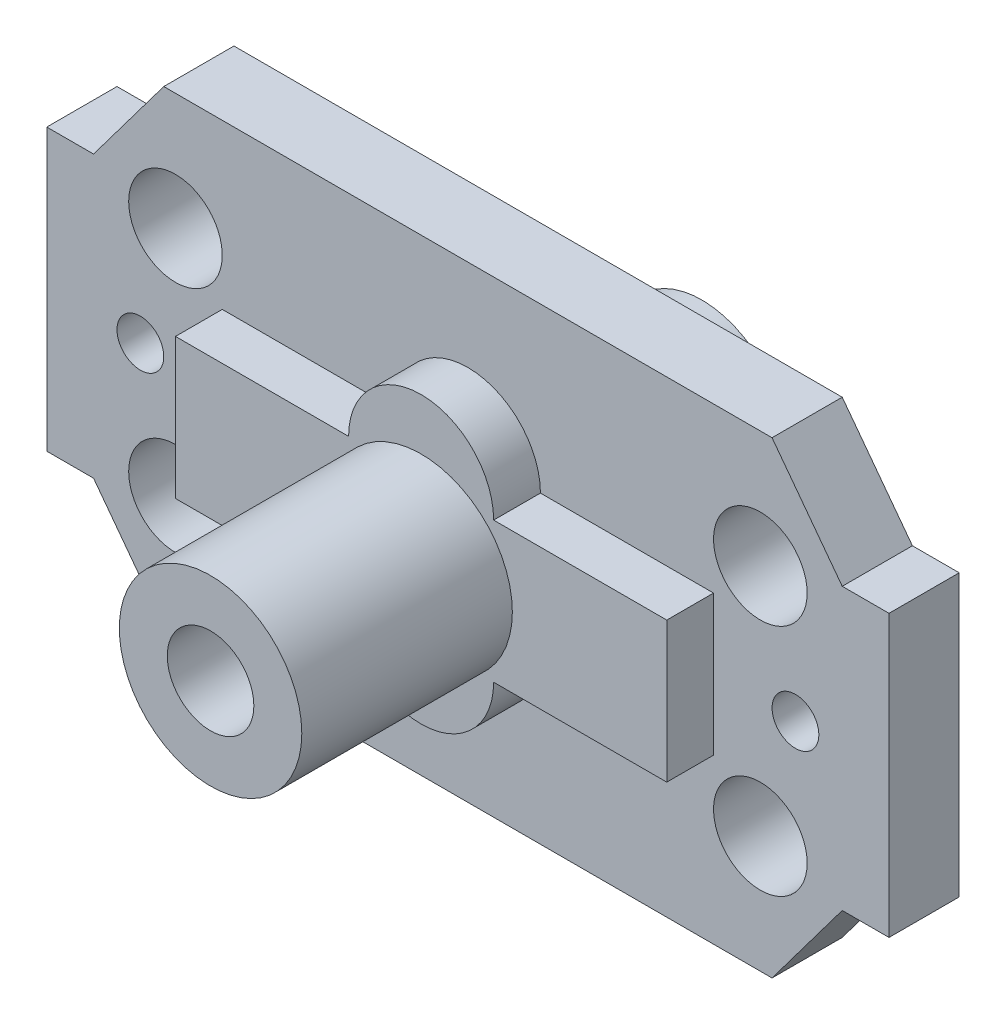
ISO-10303-21;
HEADER;
FILE_DESCRIPTION(('STEP AP214'),'2;1');
FILE_NAME('part.step','',(''),(''),'','','');
FILE_SCHEMA(('AUTOMOTIVE_DESIGN { 1 0 10303 214 1 1 1 1 }'));
ENDSEC;
DATA;
#1=APPLICATION_CONTEXT('core data for automotive mechanical design processes');
#2=APPLICATION_PROTOCOL_DEFINITION('international standard','automotive_design',2000,#1);
#3=PRODUCT_CONTEXT('',#1,'mechanical');
#4=PRODUCT('Part','Part','',(#3));
#5=PRODUCT_RELATED_PRODUCT_CATEGORY('part','',(#4));
#6=PRODUCT_DEFINITION_FORMATION('','',#4);
#7=PRODUCT_DEFINITION_CONTEXT('part definition',#1,'design');
#8=PRODUCT_DEFINITION('design','',#6,#7);
#9=PRODUCT_DEFINITION_SHAPE('','',#8);
#10=(LENGTH_UNIT() NAMED_UNIT(*) SI_UNIT(.MILLI.,.METRE.));
#11=(NAMED_UNIT(*) PLANE_ANGLE_UNIT() SI_UNIT($,.RADIAN.));
#12=(NAMED_UNIT(*) SI_UNIT($,.STERADIAN.) SOLID_ANGLE_UNIT());
#13=UNCERTAINTY_MEASURE_WITH_UNIT(LENGTH_MEASURE(1.E-05),#10,'distance_accuracy_value','');
#14=(GEOMETRIC_REPRESENTATION_CONTEXT(3) GLOBAL_UNCERTAINTY_ASSIGNED_CONTEXT((#13)) GLOBAL_UNIT_ASSIGNED_CONTEXT((#10,
#11,#12)) REPRESENTATION_CONTEXT('',''));
#15=CARTESIAN_POINT('',(0.,0.,0.));
#16=DIRECTION('',(0.,0.,1.));
#17=DIRECTION('',(1.,0.,0.));
#18=AXIS2_PLACEMENT_3D('',#15,#16,#17);
#19=CARTESIAN_POINT('',(0.,1.5,2.5));
#20=DIRECTION('',(0.,0.,-1.));
#21=DIRECTION('',(-1.,0.,0.));
#22=AXIS2_PLACEMENT_3D('',#19,#20,#21);
#23=CYLINDRICAL_SURFACE('',#22,1.55);
#24=DIRECTION('',(0.,0.,-1.));
#25=VECTOR('',#24,1.);
#26=CARTESIAN_POINT('',(-1.55,1.5,2.5));
#27=LINE('',#26,#25);
#28=CARTESIAN_POINT('',(-1.55,1.5,2.5));
#29=VERTEX_POINT('',#28);
#30=CARTESIAN_POINT('',(-1.55,1.5,1.5));
#31=VERTEX_POINT('',#30);
#32=EDGE_CURVE('E206',#29,#31,#27,.T.);
#33=ORIENTED_EDGE('',*,*,#32,.F.);
#34=CARTESIAN_POINT('',(0.,1.5,2.5));
#35=DIRECTION('',(0.,0.,1.));
#36=DIRECTION('',(1.,0.,0.));
#37=AXIS2_PLACEMENT_3D('',#34,#35,#36);
#38=CIRCLE('',#37,1.55);
#39=CARTESIAN_POINT('',(1.55,1.5,2.5));
#40=VERTEX_POINT('',#39);
#41=EDGE_CURVE('E334',#40,#29,#38,.T.);
#42=ORIENTED_EDGE('',*,*,#41,.F.);
#43=DIRECTION('',(0.,0.,-1.));
#44=VECTOR('',#43,1.);
#45=CARTESIAN_POINT('',(1.55,1.5,2.5));
#46=LINE('',#45,#44);
#47=CARTESIAN_POINT('',(1.55,1.5,1.5));
#48=VERTEX_POINT('',#47);
#49=EDGE_CURVE('E336',#40,#48,#46,.T.);
#50=ORIENTED_EDGE('',*,*,#49,.T.);
#51=CARTESIAN_POINT('',(0.,1.5,1.5));
#52=DIRECTION('',(0.,0.,1.));
#53=DIRECTION('',(1.,0.,0.));
#54=AXIS2_PLACEMENT_3D('',#51,#52,#53);
#55=CIRCLE('',#54,1.55);
#56=EDGE_CURVE('E48',#48,#31,#55,.T.);
#57=ORIENTED_EDGE('',*,*,#56,.T.);
#58=EDGE_LOOP('',(#33,#42,#50,#57));
#59=FACE_BOUND('',#58,.T.);
#60=ADVANCED_FACE('F32',(#59),#23,.T.);
#61=CARTESIAN_POINT('',(0.,-1.5,2.5));
#62=DIRECTION('',(0.,0.,-1.));
#63=DIRECTION('',(-1.,0.,0.));
#64=AXIS2_PLACEMENT_3D('',#61,#62,#63);
#65=CYLINDRICAL_SURFACE('',#64,1.55);
#66=DIRECTION('',(0.,0.,-1.));
#67=VECTOR('',#66,1.);
#68=CARTESIAN_POINT('',(-1.55,-1.5,2.5));
#69=LINE('',#68,#67);
#70=CARTESIAN_POINT('',(-1.55,-1.5,2.5));
#71=VERTEX_POINT('',#70);
#72=CARTESIAN_POINT('',(-1.55,-1.5,1.5));
#73=VERTEX_POINT('',#72);
#74=EDGE_CURVE('E190',#71,#73,#69,.T.);
#75=ORIENTED_EDGE('',*,*,#74,.T.);
#76=CARTESIAN_POINT('',(0.,-1.5,1.5));
#77=DIRECTION('',(0.,0.,-1.));
#78=DIRECTION('',(1.,0.,0.));
#79=AXIS2_PLACEMENT_3D('',#76,#77,#78);
#80=CIRCLE('',#79,1.55);
#81=CARTESIAN_POINT('',(1.55,-1.5,1.5));
#82=VERTEX_POINT('',#81);
#83=EDGE_CURVE('E267',#82,#73,#80,.T.);
#84=ORIENTED_EDGE('',*,*,#83,.F.);
#85=DIRECTION('',(0.,0.,-1.));
#86=VECTOR('',#85,1.);
#87=CARTESIAN_POINT('',(1.55,-1.5,2.5));
#88=LINE('',#87,#86);
#89=CARTESIAN_POINT('',(1.55,-1.5,2.5));
#90=VERTEX_POINT('',#89);
#91=EDGE_CURVE('E269',#90,#82,#88,.T.);
#92=ORIENTED_EDGE('',*,*,#91,.F.);
#93=CARTESIAN_POINT('',(0.,-1.5,2.5));
#94=DIRECTION('',(0.,0.,-1.));
#95=DIRECTION('',(1.,0.,0.));
#96=AXIS2_PLACEMENT_3D('',#93,#94,#95);
#97=CIRCLE('',#96,1.55);
#98=EDGE_CURVE('E266',#90,#71,#97,.T.);
#99=ORIENTED_EDGE('',*,*,#98,.T.);
#100=EDGE_LOOP('',(#75,#84,#92,#99));
#101=FACE_BOUND('',#100,.T.);
#102=ADVANCED_FACE('F393',(#101),#65,.T.);
#103=CARTESIAN_POINT('',(0.,0.,7.));
#104=DIRECTION('',(0.,0.,-1.));
#105=DIRECTION('',(-1.,0.,0.));
#106=AXIS2_PLACEMENT_3D('',#103,#104,#105);
#107=CYLINDRICAL_SURFACE('',#106,1.95);
#108=CARTESIAN_POINT('',(0.,0.,7.));
#109=DIRECTION('',(0.,0.,1.));
#110=DIRECTION('',(1.,0.,0.));
#111=AXIS2_PLACEMENT_3D('',#108,#109,#110);
#112=CIRCLE('',#111,1.95);
#113=CARTESIAN_POINT('',(1.95,0.,7.));
#114=VERTEX_POINT('',#113);
#115=EDGE_CURVE('E324',#114,#114,#112,.T.);
#116=ORIENTED_EDGE('',*,*,#115,.F.);
#117=EDGE_LOOP('',(#116));
#118=FACE_BOUND('',#117,.T.);
#119=CARTESIAN_POINT('',(0.,0.,2.5));
#120=DIRECTION('',(0.,0.,1.));
#121=DIRECTION('',(1.,0.,0.));
#122=AXIS2_PLACEMENT_3D('',#119,#120,#121);
#123=CIRCLE('',#122,1.95);
#124=CARTESIAN_POINT('',(1.95,0.,2.5));
#125=VERTEX_POINT('',#124);
#126=EDGE_CURVE('E365',#125,#125,#123,.F.);
#127=ORIENTED_EDGE('',*,*,#126,.F.);
#128=EDGE_LOOP('',(#127));
#129=FACE_BOUND('',#128,.T.);
#130=ADVANCED_FACE('F399',(#118,#129),#107,.T.);
#131=CARTESIAN_POINT('',(9.,0.,0.));
#132=DIRECTION('',(0.,0.,1.));
#133=DIRECTION('',(1.,0.,0.));
#134=AXIS2_PLACEMENT_3D('',#131,#132,#133);
#135=PLANE('',#134);
#136=CARTESIAN_POINT('',(0.,0.,0.));
#137=DIRECTION('',(0.,0.,-1.));
#138=DIRECTION('',(-1.,0.,0.));
#139=AXIS2_PLACEMENT_3D('',#136,#137,#138);
#140=CIRCLE('',#139,1.8);
#141=CARTESIAN_POINT('',(-1.8,0.,0.));
#142=VERTEX_POINT('',#141);
#143=EDGE_CURVE('E320',#142,#142,#140,.T.);
#144=ORIENTED_EDGE('',*,*,#143,.F.);
#145=EDGE_LOOP('',(#144));
#146=FACE_BOUND('',#145,.T.);
#147=CARTESIAN_POINT('',(7.,0.,0.));
#148=DIRECTION('',(0.,0.,1.));
#149=DIRECTION('',(1.,0.,0.));
#150=AXIS2_PLACEMENT_3D('',#147,#148,#149);
#151=CIRCLE('',#150,0.500000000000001);
#152=CARTESIAN_POINT('',(7.5,0.,0.));
#153=VERTEX_POINT('',#152);
#154=EDGE_CURVE('E317',#153,#153,#151,.T.);
#155=ORIENTED_EDGE('',*,*,#154,.T.);
#156=EDGE_LOOP('',(#155));
#157=FACE_BOUND('',#156,.T.);
#158=CARTESIAN_POINT('',(6.25,2.5,0.));
#159=DIRECTION('',(0.,0.,1.));
#160=DIRECTION('',(1.,0.,0.));
#161=AXIS2_PLACEMENT_3D('',#158,#159,#160);
#162=CIRCLE('',#161,1.);
#163=CARTESIAN_POINT('',(7.25,2.5,0.));
#164=VERTEX_POINT('',#163);
#165=EDGE_CURVE('E314',#164,#164,#162,.T.);
#166=ORIENTED_EDGE('',*,*,#165,.T.);
#167=EDGE_LOOP('',(#166));
#168=FACE_BOUND('',#167,.T.);
#169=CARTESIAN_POINT('',(3.5,2.,0.));
#170=DIRECTION('',(0.,0.,1.));
#171=DIRECTION('',(1.,0.,0.));
#172=AXIS2_PLACEMENT_3D('',#169,#170,#171);
#173=CIRCLE('',#172,0.5);
#174=CARTESIAN_POINT('',(4.,2.,0.));
#175=VERTEX_POINT('',#174);
#176=EDGE_CURVE('E372',#175,#175,#173,.F.);
#177=ORIENTED_EDGE('',*,*,#176,.F.);
#178=EDGE_LOOP('',(#177));
#179=FACE_BOUND('',#178,.T.);
#180=DIRECTION('',(0.,1.,0.));
#181=VECTOR('',#180,1.);
#182=CARTESIAN_POINT('',(9.,0.,0.));
#183=LINE('',#182,#181);
#184=CARTESIAN_POINT('',(9.,-3.,0.));
#185=VERTEX_POINT('',#184);
#186=CARTESIAN_POINT('',(9.,3.,0.));
#187=VERTEX_POINT('',#186);
#188=EDGE_CURVE('E345',#185,#187,#183,.T.);
#189=ORIENTED_EDGE('',*,*,#188,.F.);
#190=DIRECTION('',(-1.,0.,0.));
#191=VECTOR('',#190,1.);
#192=CARTESIAN_POINT('',(8.,-3.,0.));
#193=LINE('',#192,#191);
#194=CARTESIAN_POINT('',(8.,-3.,0.));
#195=VERTEX_POINT('',#194);
#196=EDGE_CURVE('E277',#185,#195,#193,.T.);
#197=ORIENTED_EDGE('',*,*,#196,.T.);
#198=DIRECTION('',(-0.600000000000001,-0.799999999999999,0.));
#199=VECTOR('',#198,1.);
#200=CARTESIAN_POINT('',(6.5,-5.,0.));
#201=LINE('',#200,#199);
#202=CARTESIAN_POINT('',(6.5,-5.,0.));
#203=VERTEX_POINT('',#202);
#204=EDGE_CURVE('E290',#195,#203,#201,.T.);
#205=ORIENTED_EDGE('',*,*,#204,.T.);
#206=DIRECTION('',(-1.,0.,0.));
#207=VECTOR('',#206,1.);
#208=CARTESIAN_POINT('',(0.,-5.,0.));
#209=LINE('',#208,#207);
#210=CARTESIAN_POINT('',(-6.5,-5.,0.));
#211=VERTEX_POINT('',#210);
#212=EDGE_CURVE('E282',#203,#211,#209,.T.);
#213=ORIENTED_EDGE('',*,*,#212,.T.);
#214=DIRECTION('',(0.600000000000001,-0.799999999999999,0.));
#215=VECTOR('',#214,1.);
#216=CARTESIAN_POINT('',(-6.5,-5.,0.));
#217=LINE('',#216,#215);
#218=CARTESIAN_POINT('',(-8.,-3.,0.));
#219=VERTEX_POINT('',#218);
#220=EDGE_CURVE('E917',#219,#211,#217,.T.);
#221=ORIENTED_EDGE('',*,*,#220,.F.);
#222=DIRECTION('',(1.,0.,0.));
#223=VECTOR('',#222,1.);
#224=CARTESIAN_POINT('',(-8.,-3.,0.));
#225=LINE('',#224,#223);
#226=CARTESIAN_POINT('',(-9.,-3.,0.));
#227=VERTEX_POINT('',#226);
#228=EDGE_CURVE('E189',#227,#219,#225,.T.);
#229=ORIENTED_EDGE('',*,*,#228,.F.);
#230=DIRECTION('',(0.,1.,0.));
#231=VECTOR('',#230,1.);
#232=CARTESIAN_POINT('',(-9.,0.,0.));
#233=LINE('',#232,#231);
#234=CARTESIAN_POINT('',(-9.,3.,0.));
#235=VERTEX_POINT('',#234);
#236=EDGE_CURVE('E217',#227,#235,#233,.T.);
#237=ORIENTED_EDGE('',*,*,#236,.T.);
#238=DIRECTION('',(1.,0.,0.));
#239=VECTOR('',#238,1.);
#240=CARTESIAN_POINT('',(-8.,3.,0.));
#241=LINE('',#240,#239);
#242=CARTESIAN_POINT('',(-8.,3.,0.));
#243=VERTEX_POINT('',#242);
#244=EDGE_CURVE('E231',#235,#243,#241,.T.);
#245=ORIENTED_EDGE('',*,*,#244,.T.);
#246=DIRECTION('',(0.600000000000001,0.799999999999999,0.));
#247=VECTOR('',#246,1.);
#248=CARTESIAN_POINT('',(-6.5,5.,0.));
#249=LINE('',#248,#247);
#250=CARTESIAN_POINT('',(-6.5,5.,0.));
#251=VERTEX_POINT('',#250);
#252=EDGE_CURVE('E222',#243,#251,#249,.T.);
#253=ORIENTED_EDGE('',*,*,#252,.T.);
#254=DIRECTION('',(-1.,0.,0.));
#255=VECTOR('',#254,1.);
#256=CARTESIAN_POINT('',(0.,5.,0.));
#257=LINE('',#256,#255);
#258=CARTESIAN_POINT('',(6.5,5.,0.));
#259=VERTEX_POINT('',#258);
#260=EDGE_CURVE('E348',#259,#251,#257,.T.);
#261=ORIENTED_EDGE('',*,*,#260,.F.);
#262=DIRECTION('',(-0.600000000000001,0.799999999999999,0.));
#263=VECTOR('',#262,1.);
#264=CARTESIAN_POINT('',(6.5,5.,0.));
#265=LINE('',#264,#263);
#266=CARTESIAN_POINT('',(8.,3.,0.));
#267=VERTEX_POINT('',#266);
#268=EDGE_CURVE('E74',#267,#259,#265,.T.);
#269=ORIENTED_EDGE('',*,*,#268,.F.);
#270=DIRECTION('',(-1.,0.,0.));
#271=VECTOR('',#270,1.);
#272=CARTESIAN_POINT('',(8.,3.,0.));
#273=LINE('',#272,#271);
#274=EDGE_CURVE('E355',#187,#267,#273,.T.);
#275=ORIENTED_EDGE('',*,*,#274,.F.);
#276=EDGE_LOOP('',(#189,#197,#205,#213,#221,#229,#237,#245,#253,#261,#269,#275));
#277=FACE_BOUND('',#276,.T.);
#278=CARTESIAN_POINT('',(6.25,-2.5,0.));
#279=DIRECTION('',(0.,0.,-1.));
#280=DIRECTION('',(1.,0.,0.));
#281=AXIS2_PLACEMENT_3D('',#278,#279,#280);
#282=CIRCLE('',#281,1.);
#283=CARTESIAN_POINT('',(7.25,-2.5,0.));
#284=VERTEX_POINT('',#283);
#285=EDGE_CURVE('E260',#284,#284,#282,.T.);
#286=ORIENTED_EDGE('',*,*,#285,.F.);
#287=EDGE_LOOP('',(#286));
#288=FACE_BOUND('',#287,.T.);
#289=CARTESIAN_POINT('',(3.5,-2.,0.));
#290=DIRECTION('',(0.,0.,-1.));
#291=DIRECTION('',(1.,0.,0.));
#292=AXIS2_PLACEMENT_3D('',#289,#290,#291);
#293=CIRCLE('',#292,0.5);
#294=CARTESIAN_POINT('',(4.,-2.,0.));
#295=VERTEX_POINT('',#294);
#296=EDGE_CURVE('E300',#295,#295,#293,.F.);
#297=ORIENTED_EDGE('',*,*,#296,.T.);
#298=EDGE_LOOP('',(#297));
#299=FACE_BOUND('',#298,.T.);
#300=CARTESIAN_POINT('',(-7.,0.,0.));
#301=DIRECTION('',(0.,0.,-1.));
#302=DIRECTION('',(-1.,0.,0.));
#303=AXIS2_PLACEMENT_3D('',#300,#301,#302);
#304=CIRCLE('',#303,0.500000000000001);
#305=CARTESIAN_POINT('',(-7.5,0.,0.));
#306=VERTEX_POINT('',#305);
#307=EDGE_CURVE('E210',#306,#306,#304,.T.);
#308=ORIENTED_EDGE('',*,*,#307,.F.);
#309=EDGE_LOOP('',(#308));
#310=FACE_BOUND('',#309,.T.);
#311=CARTESIAN_POINT('',(-6.25,2.5,0.));
#312=DIRECTION('',(0.,0.,-1.));
#313=DIRECTION('',(-1.,0.,0.));
#314=AXIS2_PLACEMENT_3D('',#311,#312,#313);
#315=CIRCLE('',#314,1.);
#316=CARTESIAN_POINT('',(-7.25,2.5,0.));
#317=VERTEX_POINT('',#316);
#318=EDGE_CURVE('E258',#317,#317,#315,.T.);
#319=ORIENTED_EDGE('',*,*,#318,.F.);
#320=EDGE_LOOP('',(#319));
#321=FACE_BOUND('',#320,.T.);
#322=CARTESIAN_POINT('',(-3.5,2.,0.));
#323=DIRECTION('',(0.,0.,-1.));
#324=DIRECTION('',(-1.,0.,0.));
#325=AXIS2_PLACEMENT_3D('',#322,#323,#324);
#326=CIRCLE('',#325,0.5);
#327=CARTESIAN_POINT('',(-4.,2.,0.));
#328=VERTEX_POINT('',#327);
#329=EDGE_CURVE('E242',#328,#328,#326,.F.);
#330=ORIENTED_EDGE('',*,*,#329,.T.);
#331=EDGE_LOOP('',(#330));
#332=FACE_BOUND('',#331,.T.);
#333=CARTESIAN_POINT('',(-6.25,-2.5,0.));
#334=DIRECTION('',(0.,0.,1.));
#335=DIRECTION('',(-1.,0.,0.));
#336=AXIS2_PLACEMENT_3D('',#333,#334,#335);
#337=CIRCLE('',#336,1.);
#338=CARTESIAN_POINT('',(-7.25,-2.5,0.));
#339=VERTEX_POINT('',#338);
#340=EDGE_CURVE('E480',#339,#339,#337,.T.);
#341=ORIENTED_EDGE('',*,*,#340,.T.);
#342=EDGE_LOOP('',(#341));
#343=FACE_BOUND('',#342,.T.);
#344=CARTESIAN_POINT('',(-3.5,-2.,0.));
#345=DIRECTION('',(0.,0.,1.));
#346=DIRECTION('',(-1.,0.,0.));
#347=AXIS2_PLACEMENT_3D('',#344,#345,#346);
#348=CIRCLE('',#347,0.5);
#349=CARTESIAN_POINT('',(-4.,-2.,0.));
#350=VERTEX_POINT('',#349);
#351=EDGE_CURVE('E467',#350,#350,#348,.F.);
#352=ORIENTED_EDGE('',*,*,#351,.F.);
#353=EDGE_LOOP('',(#352));
#354=FACE_BOUND('',#353,.T.);
#355=ADVANCED_FACE('F418',(#146,#157,#168,#179,#277,#288,#299,#310,#321,#332,#343,#354),#135,.F.);
#356=CARTESIAN_POINT('',(0.,1.5,2.5));
#357=DIRECTION('',(0.,0.,1.));
#358=DIRECTION('',(1.,0.,0.));
#359=AXIS2_PLACEMENT_3D('',#356,#357,#358);
#360=PLANE('',#359);
#361=ORIENTED_EDGE('',*,*,#126,.T.);
#362=EDGE_LOOP('',(#361));
#363=FACE_BOUND('',#362,.T.);
#364=ORIENTED_EDGE('',*,*,#98,.F.);
#365=DIRECTION('',(-1.,0.,0.));
#366=VECTOR('',#365,1.);
#367=CARTESIAN_POINT('',(1.55,-1.5,2.5));
#368=LINE('',#367,#366);
#369=CARTESIAN_POINT('',(5.25,-1.5,2.5));
#370=VERTEX_POINT('',#369);
#371=EDGE_CURVE('E264',#370,#90,#368,.T.);
#372=ORIENTED_EDGE('',*,*,#371,.F.);
#373=DIRECTION('',(0.,1.,0.));
#374=VECTOR('',#373,1.);
#375=CARTESIAN_POINT('',(5.25,0.,2.5));
#376=LINE('',#375,#374);
#377=CARTESIAN_POINT('',(5.25,1.5,2.5));
#378=VERTEX_POINT('',#377);
#379=EDGE_CURVE('E330',#370,#378,#376,.T.);
#380=ORIENTED_EDGE('',*,*,#379,.T.);
#381=DIRECTION('',(-1.,0.,0.));
#382=VECTOR('',#381,1.);
#383=CARTESIAN_POINT('',(1.55,1.5,2.5));
#384=LINE('',#383,#382);
#385=EDGE_CURVE('E332',#378,#40,#384,.T.);
#386=ORIENTED_EDGE('',*,*,#385,.T.);
#387=ORIENTED_EDGE('',*,*,#41,.T.);
#388=DIRECTION('',(1.,0.,0.));
#389=VECTOR('',#388,1.);
#390=CARTESIAN_POINT('',(-1.55,1.5,2.5));
#391=LINE('',#390,#389);
#392=CARTESIAN_POINT('',(-5.25,1.5,2.5));
#393=VERTEX_POINT('',#392);
#394=EDGE_CURVE('E203',#393,#29,#391,.T.);
#395=ORIENTED_EDGE('',*,*,#394,.F.);
#396=DIRECTION('',(0.,1.,0.));
#397=VECTOR('',#396,1.);
#398=CARTESIAN_POINT('',(-5.25,0.,2.5));
#399=LINE('',#398,#397);
#400=CARTESIAN_POINT('',(-5.25,-1.5,2.5));
#401=VERTEX_POINT('',#400);
#402=EDGE_CURVE('E182',#401,#393,#399,.T.);
#403=ORIENTED_EDGE('',*,*,#402,.F.);
#404=DIRECTION('',(1.,0.,0.));
#405=VECTOR('',#404,1.);
#406=CARTESIAN_POINT('',(-1.55,-1.5,2.5));
#407=LINE('',#406,#405);
#408=EDGE_CURVE('E193',#401,#71,#407,.T.);
#409=ORIENTED_EDGE('',*,*,#408,.T.);
#410=EDGE_LOOP('',(#364,#372,#380,#386,#387,#395,#403,#409));
#411=FACE_BOUND('',#410,.T.);
#412=ADVANCED_FACE('F201',(#363,#411),#360,.T.);
#413=CARTESIAN_POINT('',(9.,0.,1.5));
#414=DIRECTION('',(-1.,0.,0.));
#415=DIRECTION('',(0.,0.,1.));
#416=AXIS2_PLACEMENT_3D('',#413,#414,#415);
#417=PLANE('',#416);
#418=ORIENTED_EDGE('',*,*,#188,.T.);
#419=DIRECTION('',(0.,0.,-1.));
#420=VECTOR('',#419,1.);
#421=CARTESIAN_POINT('',(9.,3.,1.5));
#422=LINE('',#421,#420);
#423=CARTESIAN_POINT('',(9.,3.,1.5));
#424=VERTEX_POINT('',#423);
#425=EDGE_CURVE('E362',#424,#187,#422,.T.);
#426=ORIENTED_EDGE('',*,*,#425,.F.);
#427=DIRECTION('',(0.,1.,0.));
#428=VECTOR('',#427,1.);
#429=CARTESIAN_POINT('',(9.,0.,1.5));
#430=LINE('',#429,#428);
#431=CARTESIAN_POINT('',(9.,-3.,1.5));
#432=VERTEX_POINT('',#431);
#433=EDGE_CURVE('E79',#432,#424,#430,.T.);
#434=ORIENTED_EDGE('',*,*,#433,.F.);
#435=DIRECTION('',(0.,0.,-1.));
#436=VECTOR('',#435,1.);
#437=CARTESIAN_POINT('',(9.,-3.,1.5));
#438=LINE('',#437,#436);
#439=EDGE_CURVE('E297',#432,#185,#438,.T.);
#440=ORIENTED_EDGE('',*,*,#439,.T.);
#441=EDGE_LOOP('',(#418,#426,#434,#440));
#442=FACE_BOUND('',#441,.T.);
#443=ADVANCED_FACE('F430',(#442),#417,.F.);
#444=CARTESIAN_POINT('',(8.,3.,1.5));
#445=DIRECTION('',(0.,-1.,0.));
#446=DIRECTION('',(0.,0.,-1.));
#447=AXIS2_PLACEMENT_3D('',#444,#445,#446);
#448=PLANE('',#447);
#449=ORIENTED_EDGE('',*,*,#274,.T.);
#450=DIRECTION('',(0.,0.,-1.));
#451=VECTOR('',#450,1.);
#452=CARTESIAN_POINT('',(8.,3.,1.5));
#453=LINE('',#452,#451);
#454=CARTESIAN_POINT('',(8.,3.,1.5));
#455=VERTEX_POINT('',#454);
#456=EDGE_CURVE('E360',#455,#267,#453,.T.);
#457=ORIENTED_EDGE('',*,*,#456,.F.);
#458=DIRECTION('',(-1.,0.,0.));
#459=VECTOR('',#458,1.);
#460=CARTESIAN_POINT('',(8.,3.,1.5));
#461=LINE('',#460,#459);
#462=EDGE_CURVE('E347',#424,#455,#461,.T.);
#463=ORIENTED_EDGE('',*,*,#462,.F.);
#464=ORIENTED_EDGE('',*,*,#425,.T.);
#465=EDGE_LOOP('',(#449,#457,#463,#464));
#466=FACE_BOUND('',#465,.T.);
#467=ADVANCED_FACE('F428',(#466),#448,.F.);
#468=CARTESIAN_POINT('',(6.5,5.,1.5));
#469=DIRECTION('',(-0.799999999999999,-0.600000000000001,0.));
#470=DIRECTION('',(0.600000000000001,-0.799999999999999,0.));
#471=AXIS2_PLACEMENT_3D('',#468,#469,#470);
#472=PLANE('',#471);
#473=ORIENTED_EDGE('',*,*,#268,.T.);
#474=DIRECTION('',(0.,0.,-1.));
#475=VECTOR('',#474,1.);
#476=CARTESIAN_POINT('',(6.5,5.,1.5));
#477=LINE('',#476,#475);
#478=CARTESIAN_POINT('',(6.5,5.,1.5));
#479=VERTEX_POINT('',#478);
#480=EDGE_CURVE('E353',#479,#259,#477,.T.);
#481=ORIENTED_EDGE('',*,*,#480,.F.);
#482=DIRECTION('',(-0.600000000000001,0.799999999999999,0.));
#483=VECTOR('',#482,1.);
#484=CARTESIAN_POINT('',(6.5,5.,1.5));
#485=LINE('',#484,#483);
#486=EDGE_CURVE('E57',#455,#479,#485,.T.);
#487=ORIENTED_EDGE('',*,*,#486,.F.);
#488=ORIENTED_EDGE('',*,*,#456,.T.);
#489=EDGE_LOOP('',(#473,#481,#487,#488));
#490=FACE_BOUND('',#489,.T.);
#491=ADVANCED_FACE('F424',(#490),#472,.F.);
#492=CARTESIAN_POINT('',(0.,5.,1.5));
#493=DIRECTION('',(0.,-1.,0.));
#494=DIRECTION('',(0.,0.,-1.));
#495=AXIS2_PLACEMENT_3D('',#492,#493,#494);
#496=PLANE('',#495);
#497=ORIENTED_EDGE('',*,*,#260,.T.);
#498=DIRECTION('',(0.,0.,-1.));
#499=VECTOR('',#498,1.);
#500=CARTESIAN_POINT('',(-6.5,5.,1.5));
#501=LINE('',#500,#499);
#502=CARTESIAN_POINT('',(-6.5,5.,1.5));
#503=VERTEX_POINT('',#502);
#504=EDGE_CURVE('E228',#503,#251,#501,.T.);
#505=ORIENTED_EDGE('',*,*,#504,.F.);
#506=DIRECTION('',(-1.,0.,0.));
#507=VECTOR('',#506,1.);
#508=CARTESIAN_POINT('',(0.,5.,1.5));
#509=LINE('',#508,#507);
#510=EDGE_CURVE('E351',#479,#503,#509,.T.);
#511=ORIENTED_EDGE('',*,*,#510,.F.);
#512=ORIENTED_EDGE('',*,*,#480,.T.);
#513=EDGE_LOOP('',(#497,#505,#511,#512));
#514=FACE_BOUND('',#513,.T.);
#515=ADVANCED_FACE('F417',(#514),#496,.F.);
#516=CARTESIAN_POINT('',(9.,0.,1.5));
#517=DIRECTION('',(0.,0.,1.));
#518=DIRECTION('',(1.,0.,0.));
#519=AXIS2_PLACEMENT_3D('',#516,#517,#518);
#520=PLANE('',#519);
#521=DIRECTION('',(1.,0.,0.));
#522=VECTOR('',#521,1.);
#523=CARTESIAN_POINT('',(-1.55,1.5,1.5));
#524=LINE('',#523,#522);
#525=CARTESIAN_POINT('',(-5.25,1.5,1.5));
#526=VERTEX_POINT('',#525);
#527=EDGE_CURVE('E204',#526,#31,#524,.T.);
#528=ORIENTED_EDGE('',*,*,#527,.T.);
#529=ORIENTED_EDGE('',*,*,#56,.F.);
#530=DIRECTION('',(-1.,0.,0.));
#531=VECTOR('',#530,1.);
#532=CARTESIAN_POINT('',(1.55,1.5,1.5));
#533=LINE('',#532,#531);
#534=CARTESIAN_POINT('',(5.25,1.5,1.5));
#535=VERTEX_POINT('',#534);
#536=EDGE_CURVE('E337',#535,#48,#533,.T.);
#537=ORIENTED_EDGE('',*,*,#536,.F.);
#538=DIRECTION('',(0.,1.,0.));
#539=VECTOR('',#538,1.);
#540=CARTESIAN_POINT('',(5.25,0.,1.5));
#541=LINE('',#540,#539);
#542=CARTESIAN_POINT('',(5.25,-1.5,1.5));
#543=VERTEX_POINT('',#542);
#544=EDGE_CURVE('E329',#543,#535,#541,.T.);
#545=ORIENTED_EDGE('',*,*,#544,.F.);
#546=DIRECTION('',(-1.,0.,0.));
#547=VECTOR('',#546,1.);
#548=CARTESIAN_POINT('',(1.55,-1.5,1.5));
#549=LINE('',#548,#547);
#550=EDGE_CURVE('E263',#543,#82,#549,.T.);
#551=ORIENTED_EDGE('',*,*,#550,.T.);
#552=ORIENTED_EDGE('',*,*,#83,.T.);
#553=DIRECTION('',(1.,0.,0.));
#554=VECTOR('',#553,1.);
#555=CARTESIAN_POINT('',(-1.55,-1.5,1.5));
#556=LINE('',#555,#554);
#557=CARTESIAN_POINT('',(-5.25,-1.5,1.5));
#558=VERTEX_POINT('',#557);
#559=EDGE_CURVE('E199',#558,#73,#556,.T.);
#560=ORIENTED_EDGE('',*,*,#559,.F.);
#561=DIRECTION('',(0.,1.,0.));
#562=VECTOR('',#561,1.);
#563=CARTESIAN_POINT('',(-5.25,0.,1.5));
#564=LINE('',#563,#562);
#565=EDGE_CURVE('E185',#558,#526,#564,.T.);
#566=ORIENTED_EDGE('',*,*,#565,.T.);
#567=EDGE_LOOP('',(#528,#529,#537,#545,#551,#552,#560,#566));
#568=FACE_BOUND('',#567,.T.);
#569=CARTESIAN_POINT('',(7.,0.,1.5));
#570=DIRECTION('',(0.,0.,1.));
#571=DIRECTION('',(1.,0.,0.));
#572=AXIS2_PLACEMENT_3D('',#569,#570,#571);
#573=CIRCLE('',#572,0.500000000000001);
#574=CARTESIAN_POINT('',(7.5,0.,1.5));
#575=VERTEX_POINT('',#574);
#576=EDGE_CURVE('E11',#575,#575,#573,.T.);
#577=ORIENTED_EDGE('',*,*,#576,.F.);
#578=EDGE_LOOP('',(#577));
#579=FACE_BOUND('',#578,.T.);
#580=CARTESIAN_POINT('',(6.25,2.5,1.5));
#581=DIRECTION('',(0.,0.,1.));
#582=DIRECTION('',(1.,0.,0.));
#583=AXIS2_PLACEMENT_3D('',#580,#581,#582);
#584=CIRCLE('',#583,1.);
#585=CARTESIAN_POINT('',(7.25,2.5,1.5));
#586=VERTEX_POINT('',#585);
#587=EDGE_CURVE('E36',#586,#586,#584,.T.);
#588=ORIENTED_EDGE('',*,*,#587,.F.);
#589=EDGE_LOOP('',(#588));
#590=FACE_BOUND('',#589,.T.);
#591=ORIENTED_EDGE('',*,*,#510,.T.);
#592=DIRECTION('',(0.600000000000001,0.799999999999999,0.));
#593=VECTOR('',#592,1.);
#594=CARTESIAN_POINT('',(-6.5,5.,1.5));
#595=LINE('',#594,#593);
#596=CARTESIAN_POINT('',(-8.,3.,1.5));
#597=VERTEX_POINT('',#596);
#598=EDGE_CURVE('E225',#597,#503,#595,.T.);
#599=ORIENTED_EDGE('',*,*,#598,.F.);
#600=DIRECTION('',(1.,0.,0.));
#601=VECTOR('',#600,1.);
#602=CARTESIAN_POINT('',(-8.,3.,1.5));
#603=LINE('',#602,#601);
#604=CARTESIAN_POINT('',(-9.,3.,1.5));
#605=VERTEX_POINT('',#604);
#606=EDGE_CURVE('E221',#605,#597,#603,.T.);
#607=ORIENTED_EDGE('',*,*,#606,.F.);
#608=DIRECTION('',(0.,1.,0.));
#609=VECTOR('',#608,1.);
#610=CARTESIAN_POINT('',(-9.,0.,1.5));
#611=LINE('',#610,#609);
#612=CARTESIAN_POINT('',(-9.,-3.,1.5));
#613=VERTEX_POINT('',#612);
#614=EDGE_CURVE('E218',#613,#605,#611,.T.);
#615=ORIENTED_EDGE('',*,*,#614,.F.);
#616=DIRECTION('',(1.,0.,0.));
#617=VECTOR('',#616,1.);
#618=CARTESIAN_POINT('',(-8.,-3.,1.5));
#619=LINE('',#618,#617);
#620=CARTESIAN_POINT('',(-8.,-3.,1.5));
#621=VERTEX_POINT('',#620);
#622=EDGE_CURVE('E914',#613,#621,#619,.T.);
#623=ORIENTED_EDGE('',*,*,#622,.T.);
#624=DIRECTION('',(0.600000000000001,-0.799999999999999,0.));
#625=VECTOR('',#624,1.);
#626=CARTESIAN_POINT('',(-6.5,-5.,1.5));
#627=LINE('',#626,#625);
#628=CARTESIAN_POINT('',(-6.5,-5.,1.5));
#629=VERTEX_POINT('',#628);
#630=EDGE_CURVE('E916',#621,#629,#627,.T.);
#631=ORIENTED_EDGE('',*,*,#630,.T.);
#632=DIRECTION('',(-1.,0.,0.));
#633=VECTOR('',#632,1.);
#634=CARTESIAN_POINT('',(0.,-5.,1.5));
#635=LINE('',#634,#633);
#636=CARTESIAN_POINT('',(6.5,-5.,1.5));
#637=VERTEX_POINT('',#636);
#638=EDGE_CURVE('E285',#637,#629,#635,.T.);
#639=ORIENTED_EDGE('',*,*,#638,.F.);
#640=DIRECTION('',(-0.600000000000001,-0.799999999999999,0.));
#641=VECTOR('',#640,1.);
#642=CARTESIAN_POINT('',(6.5,-5.,1.5));
#643=LINE('',#642,#641);
#644=CARTESIAN_POINT('',(8.,-3.,1.5));
#645=VERTEX_POINT('',#644);
#646=EDGE_CURVE('E281',#645,#637,#643,.T.);
#647=ORIENTED_EDGE('',*,*,#646,.F.);
#648=DIRECTION('',(-1.,0.,0.));
#649=VECTOR('',#648,1.);
#650=CARTESIAN_POINT('',(8.,-3.,1.5));
#651=LINE('',#650,#649);
#652=EDGE_CURVE('E278',#432,#645,#651,.T.);
#653=ORIENTED_EDGE('',*,*,#652,.F.);
#654=ORIENTED_EDGE('',*,*,#433,.T.);
#655=ORIENTED_EDGE('',*,*,#462,.T.);
#656=ORIENTED_EDGE('',*,*,#486,.T.);
#657=EDGE_LOOP('',(#591,#599,#607,#615,#623,#631,#639,#647,#653,#654,#655,#656));
#658=FACE_BOUND('',#657,.T.);
#659=CARTESIAN_POINT('',(6.25,-2.5,1.5));
#660=DIRECTION('',(0.,0.,-1.));
#661=DIRECTION('',(1.,0.,0.));
#662=AXIS2_PLACEMENT_3D('',#659,#660,#661);
#663=CIRCLE('',#662,1.);
#664=CARTESIAN_POINT('',(7.25,-2.5,1.5));
#665=VERTEX_POINT('',#664);
#666=EDGE_CURVE('E254',#665,#665,#663,.T.);
#667=ORIENTED_EDGE('',*,*,#666,.T.);
#668=EDGE_LOOP('',(#667));
#669=FACE_BOUND('',#668,.T.);
#670=CARTESIAN_POINT('',(-7.,0.,1.5));
#671=DIRECTION('',(0.,0.,-1.));
#672=DIRECTION('',(-1.,0.,0.));
#673=AXIS2_PLACEMENT_3D('',#670,#671,#672);
#674=CIRCLE('',#673,0.500000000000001);
#675=CARTESIAN_POINT('',(-7.5,0.,1.5));
#676=VERTEX_POINT('',#675);
#677=EDGE_CURVE('E251',#676,#676,#674,.T.);
#678=ORIENTED_EDGE('',*,*,#677,.T.);
#679=EDGE_LOOP('',(#678));
#680=FACE_BOUND('',#679,.T.);
#681=CARTESIAN_POINT('',(-6.25,2.5,1.5));
#682=DIRECTION('',(0.,0.,-1.));
#683=DIRECTION('',(-1.,0.,0.));
#684=AXIS2_PLACEMENT_3D('',#681,#682,#683);
#685=CIRCLE('',#684,1.);
#686=CARTESIAN_POINT('',(-7.25,2.5,1.5));
#687=VERTEX_POINT('',#686);
#688=EDGE_CURVE('E255',#687,#687,#685,.T.);
#689=ORIENTED_EDGE('',*,*,#688,.T.);
#690=EDGE_LOOP('',(#689));
#691=FACE_BOUND('',#690,.T.);
#692=CARTESIAN_POINT('',(-6.25,-2.5,1.5));
#693=DIRECTION('',(0.,0.,1.));
#694=DIRECTION('',(-1.,0.,0.));
#695=AXIS2_PLACEMENT_3D('',#692,#693,#694);
#696=CIRCLE('',#695,1.);
#697=CARTESIAN_POINT('',(-7.25,-2.5,1.5));
#698=VERTEX_POINT('',#697);
#699=EDGE_CURVE('E478',#698,#698,#696,.T.);
#700=ORIENTED_EDGE('',*,*,#699,.F.);
#701=EDGE_LOOP('',(#700));
#702=FACE_BOUND('',#701,.T.);
#703=ADVANCED_FACE('F413',(#568,#579,#590,#658,#669,#680,#691,#702),#520,.T.);
#704=CARTESIAN_POINT('',(5.25,0.,2.5));
#705=DIRECTION('',(-1.,0.,0.));
#706=DIRECTION('',(0.,0.,1.));
#707=AXIS2_PLACEMENT_3D('',#704,#705,#706);
#708=PLANE('',#707);
#709=ORIENTED_EDGE('',*,*,#544,.T.);
#710=DIRECTION('',(0.,0.,-1.));
#711=VECTOR('',#710,1.);
#712=CARTESIAN_POINT('',(5.25,1.5,2.5));
#713=LINE('',#712,#711);
#714=EDGE_CURVE('E342',#378,#535,#713,.T.);
#715=ORIENTED_EDGE('',*,*,#714,.F.);
#716=ORIENTED_EDGE('',*,*,#379,.F.);
#717=DIRECTION('',(0.,0.,-1.));
#718=VECTOR('',#717,1.);
#719=CARTESIAN_POINT('',(5.25,-1.5,2.5));
#720=LINE('',#719,#718);
#721=EDGE_CURVE('E274',#370,#543,#720,.T.);
#722=ORIENTED_EDGE('',*,*,#721,.T.);
#723=EDGE_LOOP('',(#709,#715,#716,#722));
#724=FACE_BOUND('',#723,.T.);
#725=ADVANCED_FACE('F409',(#724),#708,.F.);
#726=CARTESIAN_POINT('',(1.55,1.5,2.5));
#727=DIRECTION('',(0.,-1.,0.));
#728=DIRECTION('',(1.,0.,0.));
#729=AXIS2_PLACEMENT_3D('',#726,#727,#728);
#730=PLANE('',#729);
#731=ORIENTED_EDGE('',*,*,#536,.T.);
#732=ORIENTED_EDGE('',*,*,#49,.F.);
#733=ORIENTED_EDGE('',*,*,#385,.F.);
#734=ORIENTED_EDGE('',*,*,#714,.T.);
#735=EDGE_LOOP('',(#731,#732,#733,#734));
#736=FACE_BOUND('',#735,.T.);
#737=ADVANCED_FACE('F406',(#736),#730,.F.);
#738=CARTESIAN_POINT('',(0.,0.,7.));
#739=DIRECTION('',(0.,0.,1.));
#740=DIRECTION('',(1.,0.,0.));
#741=AXIS2_PLACEMENT_3D('',#738,#739,#740);
#742=PLANE('',#741);
#743=CARTESIAN_POINT('',(0.,0.,7.));
#744=DIRECTION('',(0.,0.,1.));
#745=DIRECTION('',(1.,0.,0.));
#746=AXIS2_PLACEMENT_3D('',#743,#744,#745);
#747=CIRCLE('',#746,0.925136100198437);
#748=CARTESIAN_POINT('',(0.925136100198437,0.,7.));
#749=VERTEX_POINT('',#748);
#750=EDGE_CURVE('E306',#749,#749,#747,.T.);
#751=ORIENTED_EDGE('',*,*,#750,.F.);
#752=EDGE_LOOP('',(#751));
#753=FACE_BOUND('',#752,.T.);
#754=ORIENTED_EDGE('',*,*,#115,.T.);
#755=EDGE_LOOP('',(#754));
#756=FACE_BOUND('',#755,.T.);
#757=ADVANCED_FACE('F390',(#753,#756),#742,.T.);
#758=CARTESIAN_POINT('',(3.5,2.,-1.));
#759=DIRECTION('',(0.,0.,1.));
#760=DIRECTION('',(1.,0.,0.));
#761=AXIS2_PLACEMENT_3D('',#758,#759,#760);
#762=CYLINDRICAL_SURFACE('',#761,0.5);
#763=CARTESIAN_POINT('',(3.5,2.,-0.5));
#764=DIRECTION('',(0.,0.,1.));
#765=DIRECTION('',(1.,0.,0.));
#766=AXIS2_PLACEMENT_3D('',#763,#764,#765);
#767=CIRCLE('',#766,0.5);
#768=CARTESIAN_POINT('',(4.,2.,-0.5));
#769=VERTEX_POINT('',#768);
#770=EDGE_CURVE('E41',#769,#769,#767,.T.);
#771=ORIENTED_EDGE('',*,*,#770,.T.);
#772=EDGE_LOOP('',(#771));
#773=FACE_BOUND('',#772,.T.);
#774=ORIENTED_EDGE('',*,*,#176,.T.);
#775=EDGE_LOOP('',(#774));
#776=FACE_BOUND('',#775,.T.);
#777=ADVANCED_FACE('F378',(#773,#776),#762,.T.);
#778=CARTESIAN_POINT('',(3.5,2.,-0.5));
#779=DIRECTION('',(0.,0.,1.));
#780=DIRECTION('',(1.,0.,0.));
#781=AXIS2_PLACEMENT_3D('',#778,#779,#780);
#782=SPHERICAL_SURFACE('',#781,0.5);
#783=ORIENTED_EDGE('',*,*,#770,.F.);
#784=EDGE_LOOP('',(#783));
#785=FACE_BOUND('',#784,.T.);
#786=ADVANCED_FACE('F34',(#785),#782,.T.);
#787=CARTESIAN_POINT('',(0.,0.,-3.5));
#788=DIRECTION('',(0.,0.,1.));
#789=DIRECTION('',(1.,0.,0.));
#790=AXIS2_PLACEMENT_3D('',#787,#788,#789);
#791=CYLINDRICAL_SURFACE('',#790,1.8);
#792=CARTESIAN_POINT('',(0.,0.,-3.5));
#793=DIRECTION('',(0.,0.,-1.));
#794=DIRECTION('',(-1.,0.,0.));
#795=AXIS2_PLACEMENT_3D('',#792,#793,#794);
#796=CIRCLE('',#795,1.8);
#797=CARTESIAN_POINT('',(-1.8,0.,-3.5));
#798=VERTEX_POINT('',#797);
#799=EDGE_CURVE('E321',#798,#798,#796,.T.);
#800=ORIENTED_EDGE('',*,*,#799,.F.);
#801=EDGE_LOOP('',(#800));
#802=FACE_BOUND('',#801,.T.);
#803=ORIENTED_EDGE('',*,*,#143,.T.);
#804=EDGE_LOOP('',(#803));
#805=FACE_BOUND('',#804,.T.);
#806=ADVANCED_FACE('F382',(#802,#805),#791,.T.);
#807=CARTESIAN_POINT('',(0.,0.,-3.5));
#808=DIRECTION('',(0.,0.,-1.));
#809=DIRECTION('',(-1.,0.,0.));
#810=AXIS2_PLACEMENT_3D('',#807,#808,#809);
#811=PLANE('',#810);
#812=CARTESIAN_POINT('',(0.,0.,-3.5));
#813=DIRECTION('',(0.,0.,1.));
#814=DIRECTION('',(1.,0.,0.));
#815=AXIS2_PLACEMENT_3D('',#812,#813,#814);
#816=CIRCLE('',#815,0.925136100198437);
#817=CARTESIAN_POINT('',(0.925136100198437,0.,-3.5));
#818=VERTEX_POINT('',#817);
#819=EDGE_CURVE('E311',#818,#818,#816,.T.);
#820=ORIENTED_EDGE('',*,*,#819,.T.);
#821=EDGE_LOOP('',(#820));
#822=FACE_BOUND('',#821,.T.);
#823=ORIENTED_EDGE('',*,*,#799,.T.);
#824=EDGE_LOOP('',(#823));
#825=FACE_BOUND('',#824,.T.);
#826=ADVANCED_FACE('F387',(#822,#825),#811,.T.);
#827=CARTESIAN_POINT('',(7.,0.,-3.5));
#828=DIRECTION('',(0.,0.,1.));
#829=DIRECTION('',(1.,0.,0.));
#830=AXIS2_PLACEMENT_3D('',#827,#828,#829);
#831=CYLINDRICAL_SURFACE('',#830,0.500000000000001);
#832=ORIENTED_EDGE('',*,*,#576,.T.);
#833=EDGE_LOOP('',(#832));
#834=FACE_BOUND('',#833,.T.);
#835=ORIENTED_EDGE('',*,*,#154,.F.);
#836=EDGE_LOOP('',(#835));
#837=FACE_BOUND('',#836,.T.);
#838=ADVANCED_FACE('F582',(#834,#837),#831,.F.);
#839=CARTESIAN_POINT('',(6.25,2.5,-3.5));
#840=DIRECTION('',(0.,0.,1.));
#841=DIRECTION('',(1.,0.,0.));
#842=AXIS2_PLACEMENT_3D('',#839,#840,#841);
#843=CYLINDRICAL_SURFACE('',#842,1.);
#844=ORIENTED_EDGE('',*,*,#587,.T.);
#845=EDGE_LOOP('',(#844));
#846=FACE_BOUND('',#845,.T.);
#847=ORIENTED_EDGE('',*,*,#165,.F.);
#848=EDGE_LOOP('',(#847));
#849=FACE_BOUND('',#848,.T.);
#850=ADVANCED_FACE('F578',(#846,#849),#843,.F.);
#851=CARTESIAN_POINT('',(0.,0.,-3.5));
#852=DIRECTION('',(0.,0.,1.));
#853=DIRECTION('',(1.,0.,0.));
#854=AXIS2_PLACEMENT_3D('',#851,#852,#853);
#855=CYLINDRICAL_SURFACE('',#854,0.925136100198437);
#856=ORIENTED_EDGE('',*,*,#819,.F.);
#857=EDGE_LOOP('',(#856));
#858=FACE_BOUND('',#857,.T.);
#859=ORIENTED_EDGE('',*,*,#750,.T.);
#860=EDGE_LOOP('',(#859));
#861=FACE_BOUND('',#860,.T.);
#862=ADVANCED_FACE('F571',(#858,#861),#855,.F.);
#863=CARTESIAN_POINT('',(8.,-3.,1.5));
#864=DIRECTION('',(0.,1.,0.));
#865=DIRECTION('',(0.,0.,-1.));
#866=AXIS2_PLACEMENT_3D('',#863,#864,#865);
#867=PLANE('',#866);
#868=ORIENTED_EDGE('',*,*,#196,.F.);
#869=ORIENTED_EDGE('',*,*,#439,.F.);
#870=ORIENTED_EDGE('',*,*,#652,.T.);
#871=DIRECTION('',(0.,0.,-1.));
#872=VECTOR('',#871,1.);
#873=CARTESIAN_POINT('',(8.,-3.,1.5));
#874=LINE('',#873,#872);
#875=EDGE_CURVE('E295',#645,#195,#874,.T.);
#876=ORIENTED_EDGE('',*,*,#875,.T.);
#877=EDGE_LOOP('',(#868,#869,#870,#876));
#878=FACE_BOUND('',#877,.T.);
#879=ADVANCED_FACE('F567',(#878),#867,.F.);
#880=CARTESIAN_POINT('',(6.5,-5.,1.5));
#881=DIRECTION('',(-0.799999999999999,0.600000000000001,0.));
#882=DIRECTION('',(0.600000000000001,0.799999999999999,0.));
#883=AXIS2_PLACEMENT_3D('',#880,#881,#882);
#884=PLANE('',#883);
#885=ORIENTED_EDGE('',*,*,#204,.F.);
#886=ORIENTED_EDGE('',*,*,#875,.F.);
#887=ORIENTED_EDGE('',*,*,#646,.T.);
#888=DIRECTION('',(0.,0.,-1.));
#889=VECTOR('',#888,1.);
#890=CARTESIAN_POINT('',(6.5,-5.,1.5));
#891=LINE('',#890,#889);
#892=EDGE_CURVE('E287',#637,#203,#891,.T.);
#893=ORIENTED_EDGE('',*,*,#892,.T.);
#894=EDGE_LOOP('',(#885,#886,#887,#893));
#895=FACE_BOUND('',#894,.T.);
#896=ADVANCED_FACE('F563',(#895),#884,.F.);
#897=CARTESIAN_POINT('',(0.,-5.,1.5));
#898=DIRECTION('',(0.,1.,0.));
#899=DIRECTION('',(0.,0.,-1.));
#900=AXIS2_PLACEMENT_3D('',#897,#898,#899);
#901=PLANE('',#900);
#902=ORIENTED_EDGE('',*,*,#212,.F.);
#903=ORIENTED_EDGE('',*,*,#892,.F.);
#904=ORIENTED_EDGE('',*,*,#638,.T.);
#905=DIRECTION('',(0.,0.,-1.));
#906=VECTOR('',#905,1.);
#907=CARTESIAN_POINT('',(-6.5,-5.,1.5));
#908=LINE('',#907,#906);
#909=EDGE_CURVE('E472',#629,#211,#908,.T.);
#910=ORIENTED_EDGE('',*,*,#909,.T.);
#911=EDGE_LOOP('',(#902,#903,#904,#910));
#912=FACE_BOUND('',#911,.T.);
#913=ADVANCED_FACE('F559',(#912),#901,.F.);
#914=CARTESIAN_POINT('',(1.55,-1.5,2.5));
#915=DIRECTION('',(0.,1.,0.));
#916=DIRECTION('',(1.,0.,0.));
#917=AXIS2_PLACEMENT_3D('',#914,#915,#916);
#918=PLANE('',#917);
#919=ORIENTED_EDGE('',*,*,#550,.F.);
#920=ORIENTED_EDGE('',*,*,#721,.F.);
#921=ORIENTED_EDGE('',*,*,#371,.T.);
#922=ORIENTED_EDGE('',*,*,#91,.T.);
#923=EDGE_LOOP('',(#919,#920,#921,#922));
#924=FACE_BOUND('',#923,.T.);
#925=ADVANCED_FACE('F554',(#924),#918,.F.);
#926=CARTESIAN_POINT('',(3.5,-2.,-1.));
#927=DIRECTION('',(0.,0.,1.));
#928=DIRECTION('',(1.,0.,0.));
#929=AXIS2_PLACEMENT_3D('',#926,#927,#928);
#930=CYLINDRICAL_SURFACE('',#929,0.5);
#931=CARTESIAN_POINT('',(3.5,-2.,-0.5));
#932=DIRECTION('',(0.,0.,-1.));
#933=DIRECTION('',(1.,0.,0.));
#934=AXIS2_PLACEMENT_3D('',#931,#932,#933);
#935=CIRCLE('',#934,0.5);
#936=CARTESIAN_POINT('',(4.,-2.,-0.5));
#937=VERTEX_POINT('',#936);
#938=EDGE_CURVE('E303',#937,#937,#935,.T.);
#939=ORIENTED_EDGE('',*,*,#938,.F.);
#940=EDGE_LOOP('',(#939));
#941=FACE_BOUND('',#940,.T.);
#942=ORIENTED_EDGE('',*,*,#296,.F.);
#943=EDGE_LOOP('',(#942));
#944=FACE_BOUND('',#943,.T.);
#945=ADVANCED_FACE('F552',(#941,#944),#930,.T.);
#946=CARTESIAN_POINT('',(3.5,-2.,-0.5));
#947=DIRECTION('',(0.,0.,1.));
#948=DIRECTION('',(1.,0.,0.));
#949=AXIS2_PLACEMENT_3D('',#946,#947,#948);
#950=SPHERICAL_SURFACE('',#949,0.5);
#951=ORIENTED_EDGE('',*,*,#938,.T.);
#952=EDGE_LOOP('',(#951));
#953=FACE_BOUND('',#952,.T.);
#954=ADVANCED_FACE('F550',(#953),#950,.T.);
#955=CARTESIAN_POINT('',(6.25,-2.5,-3.5));
#956=DIRECTION('',(0.,0.,1.));
#957=DIRECTION('',(1.,0.,0.));
#958=AXIS2_PLACEMENT_3D('',#955,#956,#957);
#959=CYLINDRICAL_SURFACE('',#958,1.);
#960=ORIENTED_EDGE('',*,*,#666,.F.);
#961=EDGE_LOOP('',(#960));
#962=FACE_BOUND('',#961,.T.);
#963=ORIENTED_EDGE('',*,*,#285,.T.);
#964=EDGE_LOOP('',(#963));
#965=FACE_BOUND('',#964,.T.);
#966=ADVANCED_FACE('F547',(#962,#965),#959,.F.);
#967=CARTESIAN_POINT('',(-6.25,-2.5,-3.5));
#968=DIRECTION('',(0.,0.,1.));
#969=DIRECTION('',(-1.,0.,0.));
#970=AXIS2_PLACEMENT_3D('',#967,#968,#969);
#971=CYLINDRICAL_SURFACE('',#970,1.);
#972=ORIENTED_EDGE('',*,*,#699,.T.);
#973=EDGE_LOOP('',(#972));
#974=FACE_BOUND('',#973,.T.);
#975=ORIENTED_EDGE('',*,*,#340,.F.);
#976=EDGE_LOOP('',(#975));
#977=FACE_BOUND('',#976,.T.);
#978=ADVANCED_FACE('F509',(#974,#977),#971,.F.);
#979=CARTESIAN_POINT('',(-3.5,-2.,-0.5));
#980=DIRECTION('',(0.,0.,1.));
#981=DIRECTION('',(-1.,0.,0.));
#982=AXIS2_PLACEMENT_3D('',#979,#980,#981);
#983=SPHERICAL_SURFACE('',#982,0.5);
#984=CARTESIAN_POINT('',(-3.5,-2.,-0.5));
#985=DIRECTION('',(0.,0.,1.));
#986=DIRECTION('',(-1.,0.,0.));
#987=AXIS2_PLACEMENT_3D('',#984,#985,#986);
#988=CIRCLE('',#987,0.5);
#989=CARTESIAN_POINT('',(-4.,-2.,-0.5));
#990=VERTEX_POINT('',#989);
#991=EDGE_CURVE('E259',#990,#990,#988,.T.);
#992=ORIENTED_EDGE('',*,*,#991,.F.);
#993=EDGE_LOOP('',(#992));
#994=FACE_BOUND('',#993,.T.);
#995=ADVANCED_FACE('F500',(#994),#983,.T.);
#996=CARTESIAN_POINT('',(-3.5,-2.,-1.));
#997=DIRECTION('',(0.,0.,1.));
#998=DIRECTION('',(-1.,0.,0.));
#999=AXIS2_PLACEMENT_3D('',#996,#997,#998);
#1000=CYLINDRICAL_SURFACE('',#999,0.5);
#1001=ORIENTED_EDGE('',*,*,#991,.T.);
#1002=EDGE_LOOP('',(#1001));
#1003=FACE_BOUND('',#1002,.T.);
#1004=ORIENTED_EDGE('',*,*,#351,.T.);
#1005=EDGE_LOOP('',(#1004));
#1006=FACE_BOUND('',#1005,.T.);
#1007=ADVANCED_FACE('F498',(#1003,#1006),#1000,.T.);
#1008=CARTESIAN_POINT('',(-1.55,-1.5,2.5));
#1009=DIRECTION('',(0.,1.,0.));
#1010=DIRECTION('',(-1.,0.,0.));
#1011=AXIS2_PLACEMENT_3D('',#1008,#1009,#1010);
#1012=PLANE('',#1011);
#1013=ORIENTED_EDGE('',*,*,#559,.T.);
#1014=ORIENTED_EDGE('',*,*,#74,.F.);
#1015=ORIENTED_EDGE('',*,*,#408,.F.);
#1016=DIRECTION('',(0.,0.,-1.));
#1017=VECTOR('',#1016,1.);
#1018=CARTESIAN_POINT('',(-5.25,-1.5,2.5));
#1019=LINE('',#1018,#1017);
#1020=EDGE_CURVE('E178',#401,#558,#1019,.T.);
#1021=ORIENTED_EDGE('',*,*,#1020,.T.);
#1022=EDGE_LOOP('',(#1013,#1014,#1015,#1021));
#1023=FACE_BOUND('',#1022,.T.);
#1024=ADVANCED_FACE('F194',(#1023),#1012,.F.);
#1025=CARTESIAN_POINT('',(-6.5,-5.,1.5));
#1026=DIRECTION('',(0.799999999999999,0.600000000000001,0.));
#1027=DIRECTION('',(-0.600000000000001,0.799999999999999,0.));
#1028=AXIS2_PLACEMENT_3D('',#1025,#1026,#1027);
#1029=PLANE('',#1028);
#1030=ORIENTED_EDGE('',*,*,#220,.T.);
#1031=ORIENTED_EDGE('',*,*,#909,.F.);
#1032=ORIENTED_EDGE('',*,*,#630,.F.);
#1033=DIRECTION('',(0.,0.,-1.));
#1034=VECTOR('',#1033,1.);
#1035=CARTESIAN_POINT('',(-8.,-3.,1.5));
#1036=LINE('',#1035,#1034);
#1037=EDGE_CURVE('E468',#621,#219,#1036,.T.);
#1038=ORIENTED_EDGE('',*,*,#1037,.T.);
#1039=EDGE_LOOP('',(#1030,#1031,#1032,#1038));
#1040=FACE_BOUND('',#1039,.T.);
#1041=ADVANCED_FACE('F507',(#1040),#1029,.F.);
#1042=CARTESIAN_POINT('',(-8.,-3.,1.5));
#1043=DIRECTION('',(0.,1.,0.));
#1044=DIRECTION('',(0.,0.,-1.));
#1045=AXIS2_PLACEMENT_3D('',#1042,#1043,#1044);
#1046=PLANE('',#1045);
#1047=ORIENTED_EDGE('',*,*,#228,.T.);
#1048=ORIENTED_EDGE('',*,*,#1037,.F.);
#1049=ORIENTED_EDGE('',*,*,#622,.F.);
#1050=DIRECTION('',(0.,0.,-1.));
#1051=VECTOR('',#1050,1.);
#1052=CARTESIAN_POINT('',(-9.,-3.,1.5));
#1053=LINE('',#1052,#1051);
#1054=EDGE_CURVE('E463',#613,#227,#1053,.T.);
#1055=ORIENTED_EDGE('',*,*,#1054,.T.);
#1056=EDGE_LOOP('',(#1047,#1048,#1049,#1055));
#1057=FACE_BOUND('',#1056,.T.);
#1058=ADVANCED_FACE('F516',(#1057),#1046,.F.);
#1059=CARTESIAN_POINT('',(-6.25,2.5,-3.5));
#1060=DIRECTION('',(0.,0.,1.));
#1061=DIRECTION('',(-1.,0.,0.));
#1062=AXIS2_PLACEMENT_3D('',#1059,#1060,#1061);
#1063=CYLINDRICAL_SURFACE('',#1062,1.);
#1064=ORIENTED_EDGE('',*,*,#688,.F.);
#1065=EDGE_LOOP('',(#1064));
#1066=FACE_BOUND('',#1065,.T.);
#1067=ORIENTED_EDGE('',*,*,#318,.T.);
#1068=EDGE_LOOP('',(#1067));
#1069=FACE_BOUND('',#1068,.T.);
#1070=ADVANCED_FACE('F519',(#1066,#1069),#1063,.F.);
#1071=CARTESIAN_POINT('',(-7.,0.,-3.5));
#1072=DIRECTION('',(0.,0.,1.));
#1073=DIRECTION('',(-1.,0.,0.));
#1074=AXIS2_PLACEMENT_3D('',#1071,#1072,#1073);
#1075=CYLINDRICAL_SURFACE('',#1074,0.500000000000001);
#1076=ORIENTED_EDGE('',*,*,#677,.F.);
#1077=EDGE_LOOP('',(#1076));
#1078=FACE_BOUND('',#1077,.T.);
#1079=ORIENTED_EDGE('',*,*,#307,.T.);
#1080=EDGE_LOOP('',(#1079));
#1081=FACE_BOUND('',#1080,.T.);
#1082=ADVANCED_FACE('F487',(#1078,#1081),#1075,.F.);
#1083=CARTESIAN_POINT('',(-3.5,2.,-0.5));
#1084=DIRECTION('',(0.,0.,1.));
#1085=DIRECTION('',(-1.,0.,0.));
#1086=AXIS2_PLACEMENT_3D('',#1083,#1084,#1085);
#1087=SPHERICAL_SURFACE('',#1086,0.5);
#1088=CARTESIAN_POINT('',(-3.5,2.,-0.5));
#1089=DIRECTION('',(0.,0.,-1.));
#1090=DIRECTION('',(-1.,0.,0.));
#1091=AXIS2_PLACEMENT_3D('',#1088,#1089,#1090);
#1092=CIRCLE('',#1091,0.5);
#1093=CARTESIAN_POINT('',(-4.,2.,-0.5));
#1094=VERTEX_POINT('',#1093);
#1095=EDGE_CURVE('E248',#1094,#1094,#1092,.T.);
#1096=ORIENTED_EDGE('',*,*,#1095,.T.);
#1097=EDGE_LOOP('',(#1096));
#1098=FACE_BOUND('',#1097,.T.);
#1099=ADVANCED_FACE('F526',(#1098),#1087,.T.);
#1100=CARTESIAN_POINT('',(-3.5,2.,-1.));
#1101=DIRECTION('',(0.,0.,1.));
#1102=DIRECTION('',(-1.,0.,0.));
#1103=AXIS2_PLACEMENT_3D('',#1100,#1101,#1102);
#1104=CYLINDRICAL_SURFACE('',#1103,0.5);
#1105=ORIENTED_EDGE('',*,*,#1095,.F.);
#1106=EDGE_LOOP('',(#1105));
#1107=FACE_BOUND('',#1106,.T.);
#1108=ORIENTED_EDGE('',*,*,#329,.F.);
#1109=EDGE_LOOP('',(#1108));
#1110=FACE_BOUND('',#1109,.T.);
#1111=ADVANCED_FACE('F528',(#1107,#1110),#1104,.T.);
#1112=CARTESIAN_POINT('',(-1.55,1.5,2.5));
#1113=DIRECTION('',(0.,-1.,0.));
#1114=DIRECTION('',(-1.,0.,0.));
#1115=AXIS2_PLACEMENT_3D('',#1112,#1113,#1114);
#1116=PLANE('',#1115);
#1117=ORIENTED_EDGE('',*,*,#527,.F.);
#1118=DIRECTION('',(0.,0.,-1.));
#1119=VECTOR('',#1118,1.);
#1120=CARTESIAN_POINT('',(-5.25,1.5,2.5));
#1121=LINE('',#1120,#1119);
#1122=EDGE_CURVE('E215',#393,#526,#1121,.T.);
#1123=ORIENTED_EDGE('',*,*,#1122,.F.);
#1124=ORIENTED_EDGE('',*,*,#394,.T.);
#1125=ORIENTED_EDGE('',*,*,#32,.T.);
#1126=EDGE_LOOP('',(#1117,#1123,#1124,#1125));
#1127=FACE_BOUND('',#1126,.T.);
#1128=ADVANCED_FACE('F531',(#1127),#1116,.F.);
#1129=CARTESIAN_POINT('',(-5.25,0.,2.5));
#1130=DIRECTION('',(1.,0.,0.));
#1131=DIRECTION('',(0.,0.,1.));
#1132=AXIS2_PLACEMENT_3D('',#1129,#1130,#1131);
#1133=PLANE('',#1132);
#1134=ORIENTED_EDGE('',*,*,#565,.F.);
#1135=ORIENTED_EDGE('',*,*,#1020,.F.);
#1136=ORIENTED_EDGE('',*,*,#402,.T.);
#1137=ORIENTED_EDGE('',*,*,#1122,.T.);
#1138=EDGE_LOOP('',(#1134,#1135,#1136,#1137));
#1139=FACE_BOUND('',#1138,.T.);
#1140=ADVANCED_FACE('F180',(#1139),#1133,.F.);
#1141=CARTESIAN_POINT('',(-6.5,5.,1.5));
#1142=DIRECTION('',(0.799999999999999,-0.600000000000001,0.));
#1143=DIRECTION('',(-0.600000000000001,-0.799999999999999,0.));
#1144=AXIS2_PLACEMENT_3D('',#1141,#1142,#1143);
#1145=PLANE('',#1144);
#1146=ORIENTED_EDGE('',*,*,#252,.F.);
#1147=DIRECTION('',(0.,0.,-1.));
#1148=VECTOR('',#1147,1.);
#1149=CARTESIAN_POINT('',(-8.,3.,1.5));
#1150=LINE('',#1149,#1148);
#1151=EDGE_CURVE('E238',#597,#243,#1150,.T.);
#1152=ORIENTED_EDGE('',*,*,#1151,.F.);
#1153=ORIENTED_EDGE('',*,*,#598,.T.);
#1154=ORIENTED_EDGE('',*,*,#504,.T.);
#1155=EDGE_LOOP('',(#1146,#1152,#1153,#1154));
#1156=FACE_BOUND('',#1155,.T.);
#1157=ADVANCED_FACE('F450',(#1156),#1145,.F.);
#1158=CARTESIAN_POINT('',(-8.,3.,1.5));
#1159=DIRECTION('',(0.,-1.,0.));
#1160=DIRECTION('',(0.,0.,-1.));
#1161=AXIS2_PLACEMENT_3D('',#1158,#1159,#1160);
#1162=PLANE('',#1161);
#1163=ORIENTED_EDGE('',*,*,#244,.F.);
#1164=DIRECTION('',(0.,0.,-1.));
#1165=VECTOR('',#1164,1.);
#1166=CARTESIAN_POINT('',(-9.,3.,1.5));
#1167=LINE('',#1166,#1165);
#1168=EDGE_CURVE('E240',#605,#235,#1167,.T.);
#1169=ORIENTED_EDGE('',*,*,#1168,.F.);
#1170=ORIENTED_EDGE('',*,*,#606,.T.);
#1171=ORIENTED_EDGE('',*,*,#1151,.T.);
#1172=EDGE_LOOP('',(#1163,#1169,#1170,#1171));
#1173=FACE_BOUND('',#1172,.T.);
#1174=ADVANCED_FACE('F459',(#1173),#1162,.F.);
#1175=CARTESIAN_POINT('',(-9.,0.,1.5));
#1176=DIRECTION('',(1.,0.,0.));
#1177=DIRECTION('',(0.,0.,1.));
#1178=AXIS2_PLACEMENT_3D('',#1175,#1176,#1177);
#1179=PLANE('',#1178);
#1180=ORIENTED_EDGE('',*,*,#236,.F.);
#1181=ORIENTED_EDGE('',*,*,#1054,.F.);
#1182=ORIENTED_EDGE('',*,*,#614,.T.);
#1183=ORIENTED_EDGE('',*,*,#1168,.T.);
#1184=EDGE_LOOP('',(#1180,#1181,#1182,#1183));
#1185=FACE_BOUND('',#1184,.T.);
#1186=ADVANCED_FACE('F462',(#1185),#1179,.F.);
#1187=CLOSED_SHELL('',(#60,#102,#130,#355,#412,#443,#467,#491,#515,#703,#725,#737,#757,#777,
#786,#806,#826,#838,#850,#862,#879,#896,#913,#925,#945,#954,#966,#978,#995,#1007,#1024,#1041,
#1058,#1070,#1082,#1099,#1111,#1128,#1140,#1157,#1174,#1186));
#1188=MANIFOLD_SOLID_BREP('B2',#1187);
#1189=ADVANCED_BREP_SHAPE_REPRESENTATION('',(#18,#1188),#14);
#1190=SHAPE_DEFINITION_REPRESENTATION(#9,#1189);
ENDSEC;
END-ISO-10303-21;
